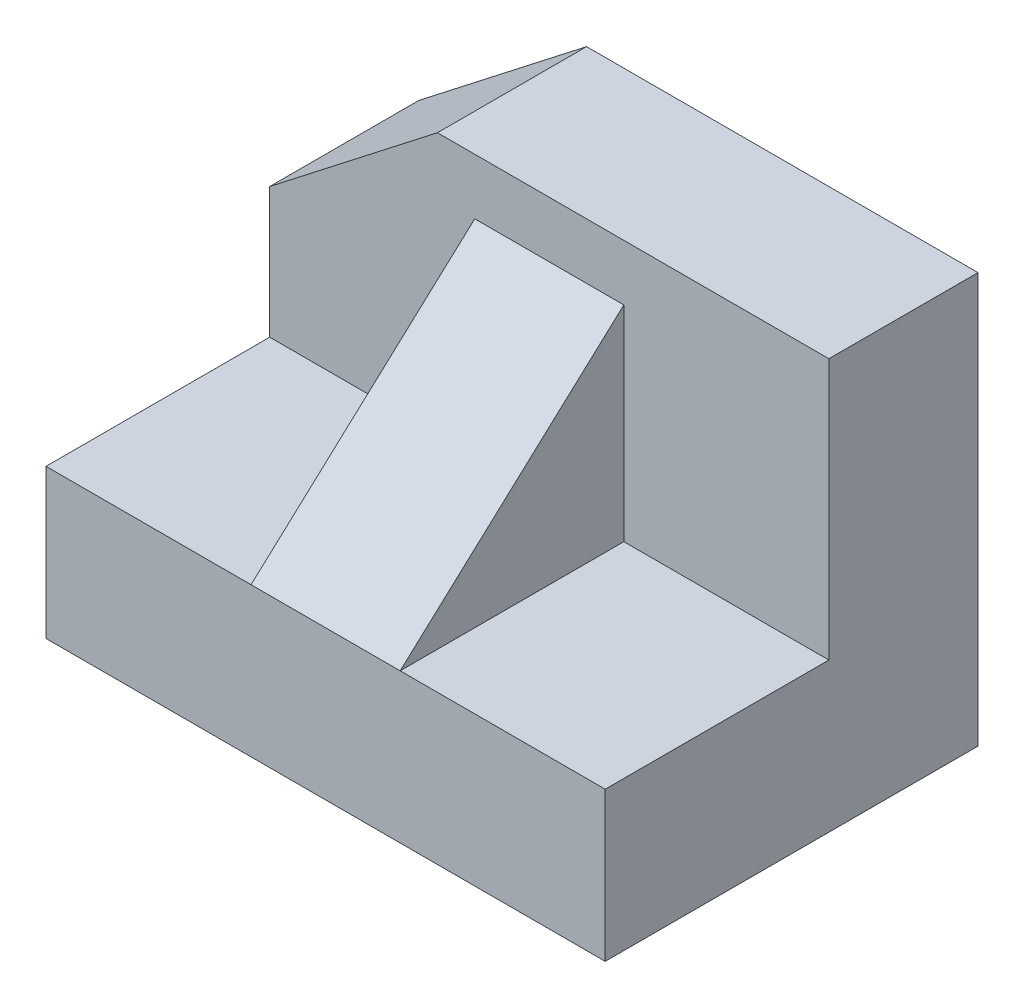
from build123d import *

# Parameters (mm, degrees)
SKETCH_1_W               = 30
SKETCH_1_H               = 20
EXTRUDE_1_DEPTH          = 8
SKETCH_2_W               = 30
SKETCH_2_H               = 8
EXTRUDE_2_DEPTH          = 14
EXTRUDE_3_DEPTH          = 8
CUT_EXTRUDE_1_DEPTH      = 40.089640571
CUT_EXTRUDE_1_DEPTH_BACK = 40.089640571


with BuildPart() as part:
    # Sketch 1 → Extrude 1 (new body)
    with BuildSketch(Plane(origin=(0, 0, 0), x_dir=(1, 0, 0), z_dir=(0, 1, 0))):
        with Locations((15, 10)):
            Rectangle(SKETCH_1_W, SKETCH_1_H)
    extrude(amount=EXTRUDE_1_DEPTH)

    # Sketch 2 → Extrude 2 (add)
    with BuildSketch(Plane(origin=(0, 8, 0), x_dir=(1, 0, 0), z_dir=(0, 1, 0))):
        with Locations((15, 16)):
            Rectangle(SKETCH_2_W, SKETCH_2_H)
    extrude(amount=EXTRUDE_2_DEPTH)

    # Sketch 3 → Extrude 3 (add)
    with BuildSketch(Plane(origin=(11, 0, 0), x_dir=(0, 0, -1), z_dir=(1, 0, 0))):
        Polygon((12, 19), (0, 8), (12, 8), align=None)
    extrude(amount=EXTRUDE_3_DEPTH)

    # Sketch 4 → Cut-Extrude 1 (cut, two sides: drawn at the far end of the back side and taken through both)
    with BuildSketch(Plane.XY.offset(-12).offset(-CUT_EXTRUDE_1_DEPTH_BACK)):
        Polygon((69.844878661, 69.323794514), (9, 22), (0, 15), (-60.844878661, -32.323794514), (-155.492467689, 89.365962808), (-24.802710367, 191.013551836), align=None)
    extrude(amount=CUT_EXTRUDE_1_DEPTH + CUT_EXTRUDE_1_DEPTH_BACK, mode=Mode.SUBTRACT)


solid = part.part
